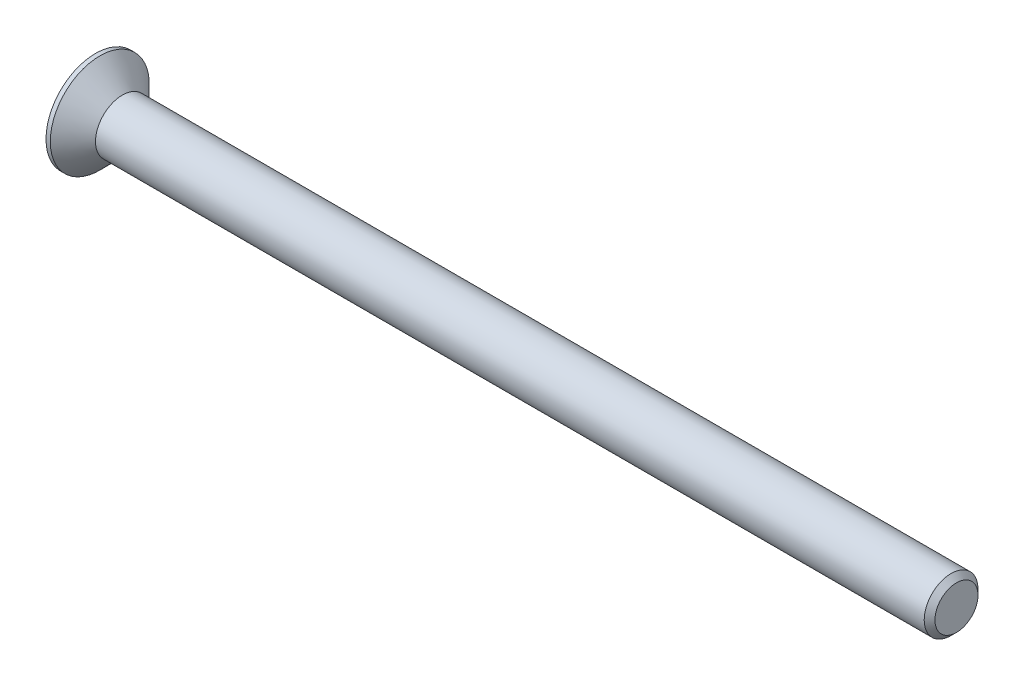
from build123d import *

# Parameters (mm, degrees)
CHAMFER1_SIZE      = 0.5
CUT_EXTRUDE1_DEPTH = 2.1


with BuildPart() as part:
    # Sketch1 → Revolve1 (revolve)
    with BuildSketch(Plane.XY, mode=Mode.PRIVATE) as revolve1_sk:
        Polygon((-2.5, 4.6), (-2.5, 0), (77.5, 0), (77.5, 2.5), (0, 2.5), (-2.1, 4.6), align=None)
    revolve(revolve1_sk.sketch.rotate(Axis((-2.5, 0, 0), (1, 0, 0)), 90), axis=Axis((-2.5, 0, 0), (1, 0, 0)))

    # Chamfer1
    chamfer1_edges = [part.edges().sort_by_distance(p)[0] for p in [
        (77.5, 0, -2.5),
    ]]
    chamfer(chamfer1_edges, length=CHAMFER1_SIZE)

    # Sketch2 → Cut-Extrude1 (cut)
    with BuildSketch(Plane.ZY.offset(2.5)):
        Polygon((-0.575, 2.3), (0.575, 2.3), (0.575, 0.575), (2.3, 0.575), (2.3, -0.575), (0.575, -0.575), (0.575, -2.3), (-0.575, -2.3), (-0.575, -0.575), (-2.3, -0.575), (-2.3, 0.575), (-0.575, 0.575), align=None)
    extrude(amount=-CUT_EXTRUDE1_DEPTH, mode=Mode.SUBTRACT)


solid = part.part
